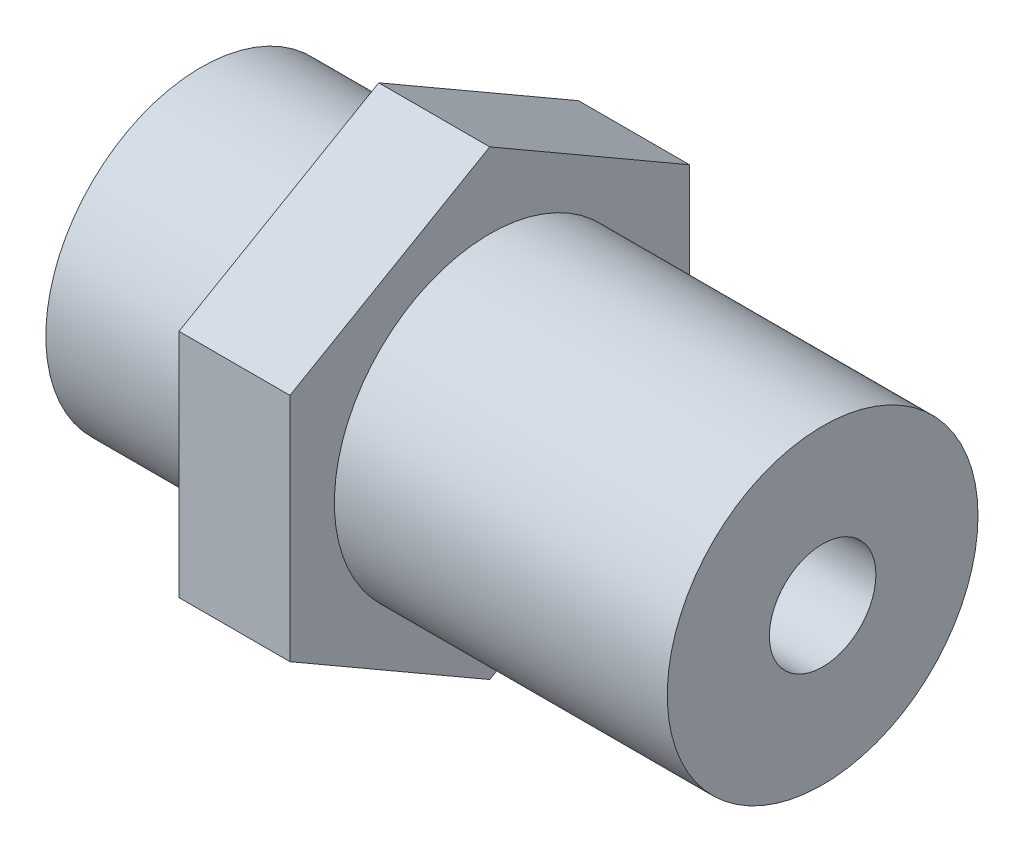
ISO-10303-21;
HEADER;
FILE_DESCRIPTION(('STEP AP214'),'2;1');
FILE_NAME('part.step','',(''),(''),'','','');
FILE_SCHEMA(('AUTOMOTIVE_DESIGN { 1 0 10303 214 1 1 1 1 }'));
ENDSEC;
DATA;
#1=APPLICATION_CONTEXT('core data for automotive mechanical design processes');
#2=APPLICATION_PROTOCOL_DEFINITION('international standard','automotive_design',2000,#1);
#3=PRODUCT_CONTEXT('',#1,'mechanical');
#4=PRODUCT('Part','Part','',(#3));
#5=PRODUCT_RELATED_PRODUCT_CATEGORY('part','',(#4));
#6=PRODUCT_DEFINITION_FORMATION('','',#4);
#7=PRODUCT_DEFINITION_CONTEXT('part definition',#1,'design');
#8=PRODUCT_DEFINITION('design','',#6,#7);
#9=PRODUCT_DEFINITION_SHAPE('','',#8);
#10=(LENGTH_UNIT() NAMED_UNIT(*) SI_UNIT(.MILLI.,.METRE.));
#11=(NAMED_UNIT(*) PLANE_ANGLE_UNIT() SI_UNIT($,.RADIAN.));
#12=(NAMED_UNIT(*) SI_UNIT($,.STERADIAN.) SOLID_ANGLE_UNIT());
#13=UNCERTAINTY_MEASURE_WITH_UNIT(LENGTH_MEASURE(1.E-05),#10,'distance_accuracy_value','');
#14=(GEOMETRIC_REPRESENTATION_CONTEXT(3) GLOBAL_UNCERTAINTY_ASSIGNED_CONTEXT((#13)) GLOBAL_UNIT_ASSIGNED_CONTEXT((#10,
#11,#12)) REPRESENTATION_CONTEXT('',''));
#15=CARTESIAN_POINT('',(0.,0.,0.));
#16=DIRECTION('',(0.,0.,1.));
#17=DIRECTION('',(1.,0.,0.));
#18=AXIS2_PLACEMENT_3D('',#15,#16,#17);
#19=CARTESIAN_POINT('',(-44.,-16.,60.4));
#20=DIRECTION('',(1.,0.,0.));
#21=DIRECTION('',(0.,0.,-1.));
#22=AXIS2_PLACEMENT_3D('',#19,#20,#21);
#23=CYLINDRICAL_SURFACE('',#22,3.5);
#24=CARTESIAN_POINT('',(-44.,-16.,60.4));
#25=DIRECTION('',(1.,0.,0.));
#26=DIRECTION('',(0.,0.,-1.));
#27=AXIS2_PLACEMENT_3D('',#24,#25,#26);
#28=CIRCLE('',#27,3.5);
#29=CARTESIAN_POINT('',(-44.,-16.,56.9));
#30=VERTEX_POINT('',#29);
#31=EDGE_CURVE('E43',#30,#30,#28,.T.);
#32=ORIENTED_EDGE('',*,*,#31,.T.);
#33=EDGE_LOOP('',(#32));
#34=FACE_BOUND('',#33,.T.);
#35=CARTESIAN_POINT('',(-40.,-16.,60.4));
#36=DIRECTION('',(1.,0.,0.));
#37=DIRECTION('',(0.,0.,-1.));
#38=AXIS2_PLACEMENT_3D('',#35,#36,#37);
#39=CIRCLE('',#38,3.5);
#40=CARTESIAN_POINT('',(-40.,-16.,56.9));
#41=VERTEX_POINT('',#40);
#42=EDGE_CURVE('E140',#41,#41,#39,.F.);
#43=ORIENTED_EDGE('',*,*,#42,.T.);
#44=EDGE_LOOP('',(#43));
#45=FACE_BOUND('',#44,.T.);
#46=ADVANCED_FACE('F33',(#34,#45),#23,.T.);
#47=CARTESIAN_POINT('',(-37.5,-16.,60.4));
#48=DIRECTION('',(1.,0.,0.));
#49=DIRECTION('',(0.,0.,-1.));
#50=AXIS2_PLACEMENT_3D('',#47,#48,#49);
#51=CIRCLE('',#50,3.5);
#52=CARTESIAN_POINT('',(-37.5,-16.,56.9));
#53=VERTEX_POINT('',#52);
#54=EDGE_CURVE('E11',#53,#53,#51,.F.);
#55=ORIENTED_EDGE('',*,*,#54,.F.);
#56=EDGE_LOOP('',(#55));
#57=FACE_BOUND('',#56,.T.);
#58=CARTESIAN_POINT('',(-30.,-16.,60.4));
#59=DIRECTION('',(1.,0.,0.));
#60=DIRECTION('',(0.,0.,-1.));
#61=AXIS2_PLACEMENT_3D('',#58,#59,#60);
#62=CIRCLE('',#61,3.5);
#63=CARTESIAN_POINT('',(-30.,-16.,56.9));
#64=VERTEX_POINT('',#63);
#65=EDGE_CURVE('E37',#64,#64,#62,.T.);
#66=ORIENTED_EDGE('',*,*,#65,.F.);
#67=EDGE_LOOP('',(#66));
#68=FACE_BOUND('',#67,.T.);
#69=ADVANCED_FACE('F35',(#57,#68),#23,.T.);
#70=CARTESIAN_POINT('',(-44.,-16.,60.4));
#71=DIRECTION('',(1.,0.,0.));
#72=DIRECTION('',(0.,0.,-1.));
#73=AXIS2_PLACEMENT_3D('',#70,#71,#72);
#74=PLANE('',#73);
#75=CARTESIAN_POINT('',(-44.,-16.,60.4));
#76=DIRECTION('',(1.,0.,0.));
#77=DIRECTION('',(0.,0.,-1.));
#78=AXIS2_PLACEMENT_3D('',#75,#76,#77);
#79=CIRCLE('',#78,1.2);
#80=CARTESIAN_POINT('',(-44.,-16.,59.2));
#81=VERTEX_POINT('',#80);
#82=EDGE_CURVE('E144',#81,#81,#79,.T.);
#83=ORIENTED_EDGE('',*,*,#82,.T.);
#84=EDGE_LOOP('',(#83));
#85=FACE_BOUND('',#84,.T.);
#86=ORIENTED_EDGE('',*,*,#31,.F.);
#87=EDGE_LOOP('',(#86));
#88=FACE_BOUND('',#87,.T.);
#89=ADVANCED_FACE('F157',(#85,#88),#74,.F.);
#90=CARTESIAN_POINT('',(-30.,-16.,60.4));
#91=DIRECTION('',(1.,0.,0.));
#92=DIRECTION('',(0.,0.,-1.));
#93=AXIS2_PLACEMENT_3D('',#90,#91,#92);
#94=PLANE('',#93);
#95=CARTESIAN_POINT('',(-30.,-16.,60.4));
#96=DIRECTION('',(1.,0.,0.));
#97=DIRECTION('',(0.,0.,-1.));
#98=AXIS2_PLACEMENT_3D('',#95,#96,#97);
#99=CIRCLE('',#98,1.2);
#100=CARTESIAN_POINT('',(-30.,-16.,59.2));
#101=VERTEX_POINT('',#100);
#102=EDGE_CURVE('E142',#101,#101,#99,.T.);
#103=ORIENTED_EDGE('',*,*,#102,.F.);
#104=EDGE_LOOP('',(#103));
#105=FACE_BOUND('',#104,.T.);
#106=ORIENTED_EDGE('',*,*,#65,.T.);
#107=EDGE_LOOP('',(#106));
#108=FACE_BOUND('',#107,.T.);
#109=ADVANCED_FACE('F154',(#105,#108),#94,.T.);
#110=CARTESIAN_POINT('',(-44.,-16.,60.4));
#111=DIRECTION('',(1.,0.,0.));
#112=DIRECTION('',(0.,0.,-1.));
#113=AXIS2_PLACEMENT_3D('',#110,#111,#112);
#114=CYLINDRICAL_SURFACE('',#113,1.2);
#115=ORIENTED_EDGE('',*,*,#102,.T.);
#116=EDGE_LOOP('',(#115));
#117=FACE_BOUND('',#116,.T.);
#118=ORIENTED_EDGE('',*,*,#82,.F.);
#119=EDGE_LOOP('',(#118));
#120=FACE_BOUND('',#119,.T.);
#121=ADVANCED_FACE('F169',(#117,#120),#114,.F.);
#122=CARTESIAN_POINT('',(-37.5,0.,0.));
#123=DIRECTION('',(1.,0.,0.));
#124=DIRECTION('',(0.,0.,-1.));
#125=AXIS2_PLACEMENT_3D('',#122,#123,#124);
#126=PLANE('',#125);
#127=ORIENTED_EDGE('',*,*,#54,.T.);
#128=EDGE_LOOP('',(#127));
#129=FACE_BOUND('',#128,.T.);
#130=DIRECTION('',(0.,0.5,0.866025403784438));
#131=VECTOR('',#130,1.);
#132=CARTESIAN_POINT('',(-37.5,-13.4019237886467,55.9));
#133=LINE('',#132,#131);
#134=CARTESIAN_POINT('',(-37.5,-13.4019237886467,55.9));
#135=VERTEX_POINT('',#134);
#136=CARTESIAN_POINT('',(-37.5,-10.8038475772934,60.4));
#137=VERTEX_POINT('',#136);
#138=EDGE_CURVE('E131',#135,#137,#133,.T.);
#139=ORIENTED_EDGE('',*,*,#138,.T.);
#140=DIRECTION('',(0.,-0.5,0.866025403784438));
#141=VECTOR('',#140,1.);
#142=CARTESIAN_POINT('',(-37.5,-10.8038475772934,60.4));
#143=LINE('',#142,#141);
#144=CARTESIAN_POINT('',(-37.5,-13.4019237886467,64.9));
#145=VERTEX_POINT('',#144);
#146=EDGE_CURVE('E90',#137,#145,#143,.T.);
#147=ORIENTED_EDGE('',*,*,#146,.T.);
#148=DIRECTION('',(0.,-1.,0.));
#149=VECTOR('',#148,1.);
#150=CARTESIAN_POINT('',(-37.5,-13.4019237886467,64.9));
#151=LINE('',#150,#149);
#152=CARTESIAN_POINT('',(-37.5,-18.5980762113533,64.9));
#153=VERTEX_POINT('',#152);
#154=EDGE_CURVE('E103',#145,#153,#151,.T.);
#155=ORIENTED_EDGE('',*,*,#154,.T.);
#156=DIRECTION('',(0.,-0.499999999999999,-0.866025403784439));
#157=VECTOR('',#156,1.);
#158=CARTESIAN_POINT('',(-37.5,-18.5980762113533,64.9));
#159=LINE('',#158,#157);
#160=CARTESIAN_POINT('',(-37.5,-21.1961524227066,60.4));
#161=VERTEX_POINT('',#160);
#162=EDGE_CURVE('E97',#153,#161,#159,.T.);
#163=ORIENTED_EDGE('',*,*,#162,.T.);
#164=DIRECTION('',(0.,0.5,-0.866025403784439));
#165=VECTOR('',#164,1.);
#166=CARTESIAN_POINT('',(-37.5,-21.1961524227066,60.4));
#167=LINE('',#166,#165);
#168=CARTESIAN_POINT('',(-37.5,-18.5980762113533,55.9));
#169=VERTEX_POINT('',#168);
#170=EDGE_CURVE('E101',#161,#169,#167,.T.);
#171=ORIENTED_EDGE('',*,*,#170,.T.);
#172=DIRECTION('',(0.,1.,0.));
#173=VECTOR('',#172,1.);
#174=CARTESIAN_POINT('',(-37.5,-18.5980762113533,55.9));
#175=LINE('',#174,#173);
#176=EDGE_CURVE('E52',#169,#135,#175,.T.);
#177=ORIENTED_EDGE('',*,*,#176,.T.);
#178=EDGE_LOOP('',(#139,#147,#155,#163,#171,#177));
#179=FACE_BOUND('',#178,.T.);
#180=ADVANCED_FACE('F99',(#129,#179),#126,.T.);
#181=CARTESIAN_POINT('',(-40.,0.,0.));
#182=DIRECTION('',(1.,0.,0.));
#183=DIRECTION('',(0.,0.,-1.));
#184=AXIS2_PLACEMENT_3D('',#181,#182,#183);
#185=PLANE('',#184);
#186=ORIENTED_EDGE('',*,*,#42,.F.);
#187=EDGE_LOOP('',(#186));
#188=FACE_BOUND('',#187,.T.);
#189=DIRECTION('',(0.,0.5,0.866025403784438));
#190=VECTOR('',#189,1.);
#191=CARTESIAN_POINT('',(-40.,-13.4019237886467,55.9));
#192=LINE('',#191,#190);
#193=CARTESIAN_POINT('',(-40.,-13.4019237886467,55.9));
#194=VERTEX_POINT('',#193);
#195=CARTESIAN_POINT('',(-40.,-10.8038475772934,60.4));
#196=VERTEX_POINT('',#195);
#197=EDGE_CURVE('E121',#194,#196,#192,.T.);
#198=ORIENTED_EDGE('',*,*,#197,.F.);
#199=DIRECTION('',(0.,1.,0.));
#200=VECTOR('',#199,1.);
#201=CARTESIAN_POINT('',(-40.,-18.5980762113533,55.9));
#202=LINE('',#201,#200);
#203=CARTESIAN_POINT('',(-40.,-18.5980762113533,55.9));
#204=VERTEX_POINT('',#203);
#205=EDGE_CURVE('E81',#204,#194,#202,.T.);
#206=ORIENTED_EDGE('',*,*,#205,.F.);
#207=DIRECTION('',(0.,0.5,-0.866025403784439));
#208=VECTOR('',#207,1.);
#209=CARTESIAN_POINT('',(-40.,-21.1961524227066,60.4));
#210=LINE('',#209,#208);
#211=CARTESIAN_POINT('',(-40.,-21.1961524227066,60.4));
#212=VERTEX_POINT('',#211);
#213=EDGE_CURVE('E75',#212,#204,#210,.T.);
#214=ORIENTED_EDGE('',*,*,#213,.F.);
#215=DIRECTION('',(0.,-0.499999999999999,-0.866025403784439));
#216=VECTOR('',#215,1.);
#217=CARTESIAN_POINT('',(-40.,-18.5980762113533,64.9));
#218=LINE('',#217,#216);
#219=CARTESIAN_POINT('',(-40.,-18.5980762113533,64.9));
#220=VERTEX_POINT('',#219);
#221=EDGE_CURVE('E111',#220,#212,#218,.T.);
#222=ORIENTED_EDGE('',*,*,#221,.F.);
#223=DIRECTION('',(0.,-1.,0.));
#224=VECTOR('',#223,1.);
#225=CARTESIAN_POINT('',(-40.,-13.4019237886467,64.9));
#226=LINE('',#225,#224);
#227=CARTESIAN_POINT('',(-40.,-13.4019237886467,64.9));
#228=VERTEX_POINT('',#227);
#229=EDGE_CURVE('E126',#228,#220,#226,.T.);
#230=ORIENTED_EDGE('',*,*,#229,.F.);
#231=DIRECTION('',(0.,-0.5,0.866025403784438));
#232=VECTOR('',#231,1.);
#233=CARTESIAN_POINT('',(-40.,-10.8038475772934,60.4));
#234=LINE('',#233,#232);
#235=EDGE_CURVE('E124',#196,#228,#234,.T.);
#236=ORIENTED_EDGE('',*,*,#235,.F.);
#237=EDGE_LOOP('',(#198,#206,#214,#222,#230,#236));
#238=FACE_BOUND('',#237,.T.);
#239=ADVANCED_FACE('F168',(#188,#238),#185,.F.);
#240=CARTESIAN_POINT('',(-37.5,-13.4019237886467,55.9));
#241=DIRECTION('',(0.,-0.866025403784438,0.5));
#242=DIRECTION('',(0.,-0.5,-0.866025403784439));
#243=AXIS2_PLACEMENT_3D('',#240,#241,#242);
#244=PLANE('',#243);
#245=ORIENTED_EDGE('',*,*,#197,.T.);
#246=DIRECTION('',(-1.,0.,0.));
#247=VECTOR('',#246,1.);
#248=CARTESIAN_POINT('',(-37.5,-10.8038475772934,60.4));
#249=LINE('',#248,#247);
#250=EDGE_CURVE('E138',#137,#196,#249,.T.);
#251=ORIENTED_EDGE('',*,*,#250,.F.);
#252=ORIENTED_EDGE('',*,*,#138,.F.);
#253=DIRECTION('',(-1.,0.,0.));
#254=VECTOR('',#253,1.);
#255=CARTESIAN_POINT('',(-37.5,-13.4019237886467,55.9));
#256=LINE('',#255,#254);
#257=EDGE_CURVE('E117',#135,#194,#256,.T.);
#258=ORIENTED_EDGE('',*,*,#257,.T.);
#259=EDGE_LOOP('',(#245,#251,#252,#258));
#260=FACE_BOUND('',#259,.T.);
#261=ADVANCED_FACE('F175',(#260),#244,.F.);
#262=CARTESIAN_POINT('',(-37.5,-10.8038475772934,60.4));
#263=DIRECTION('',(0.,-0.866025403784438,-0.5));
#264=DIRECTION('',(0.,0.5,-0.866025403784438));
#265=AXIS2_PLACEMENT_3D('',#262,#263,#264);
#266=PLANE('',#265);
#267=ORIENTED_EDGE('',*,*,#235,.T.);
#268=DIRECTION('',(-1.,0.,0.));
#269=VECTOR('',#268,1.);
#270=CARTESIAN_POINT('',(-37.5,-13.4019237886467,64.9));
#271=LINE('',#270,#269);
#272=EDGE_CURVE('E135',#145,#228,#271,.T.);
#273=ORIENTED_EDGE('',*,*,#272,.F.);
#274=ORIENTED_EDGE('',*,*,#146,.F.);
#275=ORIENTED_EDGE('',*,*,#250,.T.);
#276=EDGE_LOOP('',(#267,#273,#274,#275));
#277=FACE_BOUND('',#276,.T.);
#278=ADVANCED_FACE('F191',(#277),#266,.F.);
#279=CARTESIAN_POINT('',(-37.5,-13.4019237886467,64.9));
#280=DIRECTION('',(0.,0.,-1.));
#281=DIRECTION('',(0.,1.,0.));
#282=AXIS2_PLACEMENT_3D('',#279,#280,#281);
#283=PLANE('',#282);
#284=ORIENTED_EDGE('',*,*,#229,.T.);
#285=DIRECTION('',(-1.,0.,0.));
#286=VECTOR('',#285,1.);
#287=CARTESIAN_POINT('',(-37.5,-18.5980762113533,64.9));
#288=LINE('',#287,#286);
#289=EDGE_CURVE('E112',#153,#220,#288,.T.);
#290=ORIENTED_EDGE('',*,*,#289,.F.);
#291=ORIENTED_EDGE('',*,*,#154,.F.);
#292=ORIENTED_EDGE('',*,*,#272,.T.);
#293=EDGE_LOOP('',(#284,#290,#291,#292));
#294=FACE_BOUND('',#293,.T.);
#295=ADVANCED_FACE('F188',(#294),#283,.F.);
#296=CARTESIAN_POINT('',(-37.5,-18.5980762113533,64.9));
#297=DIRECTION('',(0.,0.866025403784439,-0.499999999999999));
#298=DIRECTION('',(0.,0.499999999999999,0.866025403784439));
#299=AXIS2_PLACEMENT_3D('',#296,#297,#298);
#300=PLANE('',#299);
#301=ORIENTED_EDGE('',*,*,#221,.T.);
#302=DIRECTION('',(-1.,0.,0.));
#303=VECTOR('',#302,1.);
#304=CARTESIAN_POINT('',(-37.5,-21.1961524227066,60.4));
#305=LINE('',#304,#303);
#306=EDGE_CURVE('E108',#161,#212,#305,.T.);
#307=ORIENTED_EDGE('',*,*,#306,.F.);
#308=ORIENTED_EDGE('',*,*,#162,.F.);
#309=ORIENTED_EDGE('',*,*,#289,.T.);
#310=EDGE_LOOP('',(#301,#307,#308,#309));
#311=FACE_BOUND('',#310,.T.);
#312=ADVANCED_FACE('F109',(#311),#300,.F.);
#313=CARTESIAN_POINT('',(-37.5,-21.1961524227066,60.4));
#314=DIRECTION('',(0.,0.866025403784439,0.5));
#315=DIRECTION('',(0.,-0.5,0.866025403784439));
#316=AXIS2_PLACEMENT_3D('',#313,#314,#315);
#317=PLANE('',#316);
#318=ORIENTED_EDGE('',*,*,#213,.T.);
#319=DIRECTION('',(-1.,0.,0.));
#320=VECTOR('',#319,1.);
#321=CARTESIAN_POINT('',(-37.5,-18.5980762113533,55.9));
#322=LINE('',#321,#320);
#323=EDGE_CURVE('E113',#169,#204,#322,.T.);
#324=ORIENTED_EDGE('',*,*,#323,.F.);
#325=ORIENTED_EDGE('',*,*,#170,.F.);
#326=ORIENTED_EDGE('',*,*,#306,.T.);
#327=EDGE_LOOP('',(#318,#324,#325,#326));
#328=FACE_BOUND('',#327,.T.);
#329=ADVANCED_FACE('F115',(#328),#317,.F.);
#330=CARTESIAN_POINT('',(-37.5,-18.5980762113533,55.9));
#331=DIRECTION('',(0.,0.,1.));
#332=DIRECTION('',(1.,0.,0.));
#333=AXIS2_PLACEMENT_3D('',#330,#331,#332);
#334=PLANE('',#333);
#335=ORIENTED_EDGE('',*,*,#205,.T.);
#336=ORIENTED_EDGE('',*,*,#257,.F.);
#337=ORIENTED_EDGE('',*,*,#176,.F.);
#338=ORIENTED_EDGE('',*,*,#323,.T.);
#339=EDGE_LOOP('',(#335,#336,#337,#338));
#340=FACE_BOUND('',#339,.T.);
#341=ADVANCED_FACE('F181',(#340),#334,.F.);
#342=CLOSED_SHELL('',(#46,#69,#89,#109,#121,#180,#239,#261,#278,#295,#312,#329,#341));
#343=MANIFOLD_SOLID_BREP('B2',#342);
#344=ADVANCED_BREP_SHAPE_REPRESENTATION('',(#18,#343),#14);
#345=SHAPE_DEFINITION_REPRESENTATION(#9,#344);
ENDSEC;
END-ISO-10303-21;
